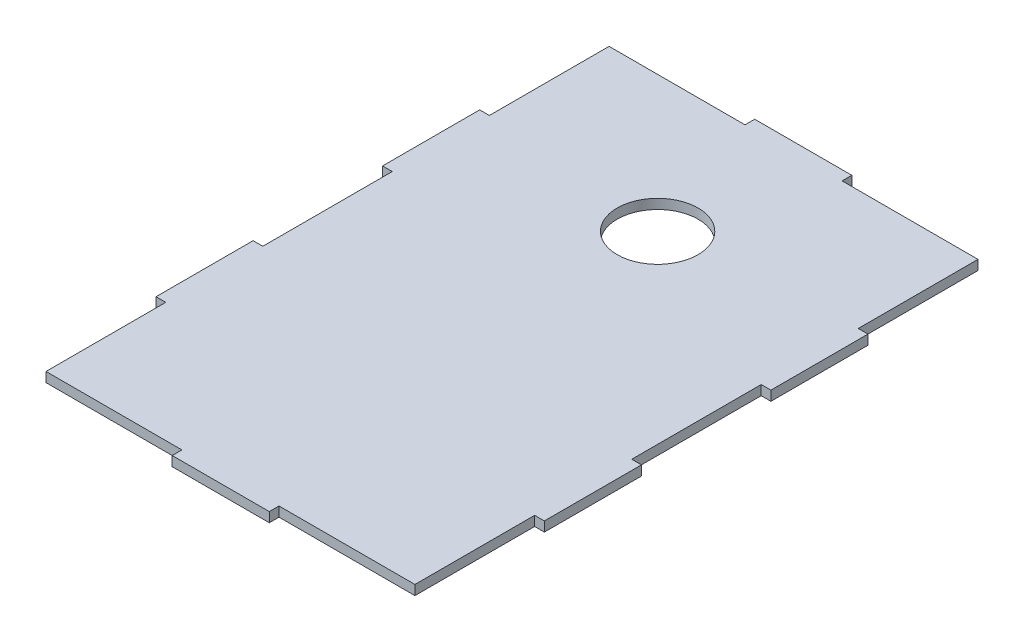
ISO-10303-21;
HEADER;
FILE_DESCRIPTION(('STEP AP214'),'2;1');
FILE_NAME('part.step','',(''),(''),'','','');
FILE_SCHEMA(('AUTOMOTIVE_DESIGN { 1 0 10303 214 1 1 1 1 }'));
ENDSEC;
DATA;
#1=APPLICATION_CONTEXT('core data for automotive mechanical design processes');
#2=APPLICATION_PROTOCOL_DEFINITION('international standard','automotive_design',2000,#1);
#3=PRODUCT_CONTEXT('',#1,'mechanical');
#4=PRODUCT('Part','Part','',(#3));
#5=PRODUCT_RELATED_PRODUCT_CATEGORY('part','',(#4));
#6=PRODUCT_DEFINITION_FORMATION('','',#4);
#7=PRODUCT_DEFINITION_CONTEXT('part definition',#1,'design');
#8=PRODUCT_DEFINITION('design','',#6,#7);
#9=PRODUCT_DEFINITION_SHAPE('','',#8);
#10=(LENGTH_UNIT() NAMED_UNIT(*) SI_UNIT(.MILLI.,.METRE.));
#11=(NAMED_UNIT(*) PLANE_ANGLE_UNIT() SI_UNIT($,.RADIAN.));
#12=(NAMED_UNIT(*) SI_UNIT($,.STERADIAN.) SOLID_ANGLE_UNIT());
#13=UNCERTAINTY_MEASURE_WITH_UNIT(LENGTH_MEASURE(1.E-05),#10,'distance_accuracy_value','');
#14=(GEOMETRIC_REPRESENTATION_CONTEXT(3) GLOBAL_UNCERTAINTY_ASSIGNED_CONTEXT((#13)) GLOBAL_UNIT_ASSIGNED_CONTEXT((#10,
#11,#12)) REPRESENTATION_CONTEXT('',''));
#15=CARTESIAN_POINT('',(0.,0.,0.));
#16=DIRECTION('',(0.,0.,1.));
#17=DIRECTION('',(1.,0.,0.));
#18=AXIS2_PLACEMENT_3D('',#15,#16,#17);
#19=CARTESIAN_POINT('',(0.,3.,0.));
#20=DIRECTION('',(0.,-1.,0.));
#21=DIRECTION('',(0.,0.,-1.));
#22=AXIS2_PLACEMENT_3D('',#19,#20,#21);
#23=PLANE('',#22);
#24=CARTESIAN_POINT('',(0.,3.,-45.));
#25=DIRECTION('',(0.,1.,0.));
#26=DIRECTION('',(0.,0.,1.));
#27=AXIS2_PLACEMENT_3D('',#24,#25,#26);
#28=CIRCLE('',#27,12.5);
#29=CARTESIAN_POINT('',(0.,3.,-32.5));
#30=VERTEX_POINT('',#29);
#31=EDGE_CURVE('E799',#30,#30,#28,.T.);
#32=ORIENTED_EDGE('',*,*,#31,.F.);
#33=EDGE_LOOP('',(#32));
#34=FACE_BOUND('',#33,.T.);
#35=DIRECTION('',(0.,0.,1.));
#36=VECTOR('',#35,1.);
#37=CARTESIAN_POINT('',(-15.,3.,0.));
#38=LINE('',#37,#36);
#39=CARTESIAN_POINT('',(-15.,3.,-90.));
#40=VERTEX_POINT('',#39);
#41=CARTESIAN_POINT('',(-15.,3.,-87.));
#42=VERTEX_POINT('',#41);
#43=EDGE_CURVE('E220',#40,#42,#38,.T.);
#44=ORIENTED_EDGE('',*,*,#43,.T.);
#45=DIRECTION('',(1.,0.,0.));
#46=VECTOR('',#45,1.);
#47=CARTESIAN_POINT('',(0.,3.,-87.));
#48=LINE('',#47,#46);
#49=CARTESIAN_POINT('',(-57.,3.,-87.));
#50=VERTEX_POINT('',#49);
#51=EDGE_CURVE('E227',#50,#42,#48,.T.);
#52=ORIENTED_EDGE('',*,*,#51,.F.);
#53=DIRECTION('',(0.,0.,-1.));
#54=VECTOR('',#53,1.);
#55=CARTESIAN_POINT('',(-57.,3.,-90.));
#56=LINE('',#55,#54);
#57=CARTESIAN_POINT('',(-57.,3.,-50.));
#58=VERTEX_POINT('',#57);
#59=EDGE_CURVE('E325',#58,#50,#56,.T.);
#60=ORIENTED_EDGE('',*,*,#59,.F.);
#61=DIRECTION('',(1.,0.,0.));
#62=VECTOR('',#61,1.);
#63=CARTESIAN_POINT('',(-60.,3.,-50.));
#64=LINE('',#63,#62);
#65=CARTESIAN_POINT('',(-60.,3.,-50.));
#66=VERTEX_POINT('',#65);
#67=EDGE_CURVE('E322',#66,#58,#64,.T.);
#68=ORIENTED_EDGE('',*,*,#67,.F.);
#69=DIRECTION('',(0.,0.,1.));
#70=VECTOR('',#69,1.);
#71=CARTESIAN_POINT('',(-60.,3.,90.));
#72=LINE('',#71,#70);
#73=CARTESIAN_POINT('',(-60.,3.,-20.));
#74=VERTEX_POINT('',#73);
#75=EDGE_CURVE('E367',#66,#74,#72,.T.);
#76=ORIENTED_EDGE('',*,*,#75,.T.);
#77=DIRECTION('',(-1.,0.,0.));
#78=VECTOR('',#77,1.);
#79=CARTESIAN_POINT('',(-60.,3.,-20.));
#80=LINE('',#79,#78);
#81=CARTESIAN_POINT('',(-57.,3.,-20.));
#82=VERTEX_POINT('',#81);
#83=EDGE_CURVE('E348',#82,#74,#80,.T.);
#84=ORIENTED_EDGE('',*,*,#83,.F.);
#85=DIRECTION('',(0.,0.,-1.));
#86=VECTOR('',#85,1.);
#87=CARTESIAN_POINT('',(-57.,3.,20.));
#88=LINE('',#87,#86);
#89=CARTESIAN_POINT('',(-57.,3.,20.));
#90=VERTEX_POINT('',#89);
#91=EDGE_CURVE('E345',#90,#82,#88,.T.);
#92=ORIENTED_EDGE('',*,*,#91,.F.);
#93=DIRECTION('',(1.,0.,0.));
#94=VECTOR('',#93,1.);
#95=CARTESIAN_POINT('',(-60.,3.,20.));
#96=LINE('',#95,#94);
#97=CARTESIAN_POINT('',(-60.,3.,20.));
#98=VERTEX_POINT('',#97);
#99=EDGE_CURVE('E294',#98,#90,#96,.T.);
#100=ORIENTED_EDGE('',*,*,#99,.F.);
#101=CARTESIAN_POINT('',(-60.,3.,50.));
#102=VERTEX_POINT('',#101);
#103=EDGE_CURVE('E364',#98,#102,#72,.T.);
#104=ORIENTED_EDGE('',*,*,#103,.T.);
#105=DIRECTION('',(-1.,0.,0.));
#106=VECTOR('',#105,1.);
#107=CARTESIAN_POINT('',(-60.,3.,50.));
#108=LINE('',#107,#106);
#109=CARTESIAN_POINT('',(-57.,3.,50.));
#110=VERTEX_POINT('',#109);
#111=EDGE_CURVE('E335',#110,#102,#108,.T.);
#112=ORIENTED_EDGE('',*,*,#111,.F.);
#113=DIRECTION('',(0.,0.,-1.));
#114=VECTOR('',#113,1.);
#115=CARTESIAN_POINT('',(-57.,3.,90.));
#116=LINE('',#115,#114);
#117=CARTESIAN_POINT('',(-57.,3.,87.));
#118=VERTEX_POINT('',#117);
#119=EDGE_CURVE('E333',#118,#110,#116,.T.);
#120=ORIENTED_EDGE('',*,*,#119,.F.);
#121=DIRECTION('',(1.,0.,0.));
#122=VECTOR('',#121,1.);
#123=CARTESIAN_POINT('',(0.,3.,87.));
#124=LINE('',#123,#122);
#125=CARTESIAN_POINT('',(-15.,3.,87.));
#126=VERTEX_POINT('',#125);
#127=EDGE_CURVE('E257',#118,#126,#124,.T.);
#128=ORIENTED_EDGE('',*,*,#127,.T.);
#129=DIRECTION('',(0.,0.,-1.));
#130=VECTOR('',#129,1.);
#131=CARTESIAN_POINT('',(-15.,3.,0.));
#132=LINE('',#131,#130);
#133=CARTESIAN_POINT('',(-15.,3.,90.));
#134=VERTEX_POINT('',#133);
#135=EDGE_CURVE('E260',#134,#126,#132,.T.);
#136=ORIENTED_EDGE('',*,*,#135,.F.);
#137=DIRECTION('',(1.,0.,0.));
#138=VECTOR('',#137,1.);
#139=CARTESIAN_POINT('',(-60.,3.,90.));
#140=LINE('',#139,#138);
#141=CARTESIAN_POINT('',(15.,3.,90.));
#142=VERTEX_POINT('',#141);
#143=EDGE_CURVE('E368',#134,#142,#140,.T.);
#144=ORIENTED_EDGE('',*,*,#143,.T.);
#145=DIRECTION('',(0.,0.,-1.));
#146=VECTOR('',#145,1.);
#147=CARTESIAN_POINT('',(15.,3.,0.));
#148=LINE('',#147,#146);
#149=CARTESIAN_POINT('',(15.,3.,87.));
#150=VERTEX_POINT('',#149);
#151=EDGE_CURVE('E271',#142,#150,#148,.T.);
#152=ORIENTED_EDGE('',*,*,#151,.T.);
#153=DIRECTION('',(-1.,0.,0.));
#154=VECTOR('',#153,1.);
#155=CARTESIAN_POINT('',(0.,3.,87.));
#156=LINE('',#155,#154);
#157=CARTESIAN_POINT('',(57.,3.,87.));
#158=VERTEX_POINT('',#157);
#159=EDGE_CURVE('E256',#158,#150,#156,.T.);
#160=ORIENTED_EDGE('',*,*,#159,.F.);
#161=DIRECTION('',(0.,0.,-1.));
#162=VECTOR('',#161,1.);
#163=CARTESIAN_POINT('',(57.,3.,90.));
#164=LINE('',#163,#162);
#165=CARTESIAN_POINT('',(57.,3.,50.));
#166=VERTEX_POINT('',#165);
#167=EDGE_CURVE('E299',#158,#166,#164,.T.);
#168=ORIENTED_EDGE('',*,*,#167,.T.);
#169=DIRECTION('',(1.,0.,0.));
#170=VECTOR('',#169,1.);
#171=CARTESIAN_POINT('',(60.,3.,50.));
#172=LINE('',#171,#170);
#173=CARTESIAN_POINT('',(60.,3.,50.));
#174=VERTEX_POINT('',#173);
#175=EDGE_CURVE('E296',#166,#174,#172,.T.);
#176=ORIENTED_EDGE('',*,*,#175,.T.);
#177=DIRECTION('',(0.,0.,-1.));
#178=VECTOR('',#177,1.);
#179=CARTESIAN_POINT('',(60.,3.,90.));
#180=LINE('',#179,#178);
#181=CARTESIAN_POINT('',(60.,3.,20.));
#182=VERTEX_POINT('',#181);
#183=EDGE_CURVE('E361',#174,#182,#180,.T.);
#184=ORIENTED_EDGE('',*,*,#183,.T.);
#185=DIRECTION('',(-1.,0.,0.));
#186=VECTOR('',#185,1.);
#187=CARTESIAN_POINT('',(60.,3.,20.));
#188=LINE('',#187,#186);
#189=CARTESIAN_POINT('',(57.,3.,20.));
#190=VERTEX_POINT('',#189);
#191=EDGE_CURVE('E311',#182,#190,#188,.T.);
#192=ORIENTED_EDGE('',*,*,#191,.T.);
#193=DIRECTION('',(0.,0.,-1.));
#194=VECTOR('',#193,1.);
#195=CARTESIAN_POINT('',(57.,3.,20.));
#196=LINE('',#195,#194);
#197=CARTESIAN_POINT('',(57.,3.,-20.));
#198=VERTEX_POINT('',#197);
#199=EDGE_CURVE('E308',#190,#198,#196,.T.);
#200=ORIENTED_EDGE('',*,*,#199,.T.);
#201=DIRECTION('',(1.,0.,0.));
#202=VECTOR('',#201,1.);
#203=CARTESIAN_POINT('',(60.,3.,-20.));
#204=LINE('',#203,#202);
#205=CARTESIAN_POINT('',(60.,3.,-20.));
#206=VERTEX_POINT('',#205);
#207=EDGE_CURVE('E282',#198,#206,#204,.T.);
#208=ORIENTED_EDGE('',*,*,#207,.T.);
#209=CARTESIAN_POINT('',(60.,3.,-50.));
#210=VERTEX_POINT('',#209);
#211=EDGE_CURVE('E358',#206,#210,#180,.T.);
#212=ORIENTED_EDGE('',*,*,#211,.T.);
#213=DIRECTION('',(-1.,0.,0.));
#214=VECTOR('',#213,1.);
#215=CARTESIAN_POINT('',(60.,3.,-50.));
#216=LINE('',#215,#214);
#217=CARTESIAN_POINT('',(57.,3.,-50.));
#218=VERTEX_POINT('',#217);
#219=EDGE_CURVE('E286',#210,#218,#216,.T.);
#220=ORIENTED_EDGE('',*,*,#219,.T.);
#221=DIRECTION('',(0.,0.,-1.));
#222=VECTOR('',#221,1.);
#223=CARTESIAN_POINT('',(57.,3.,-90.));
#224=LINE('',#223,#222);
#225=CARTESIAN_POINT('',(57.,3.,-87.));
#226=VERTEX_POINT('',#225);
#227=EDGE_CURVE('E283',#218,#226,#224,.T.);
#228=ORIENTED_EDGE('',*,*,#227,.T.);
#229=DIRECTION('',(-1.,0.,0.));
#230=VECTOR('',#229,1.);
#231=CARTESIAN_POINT('',(0.,3.,-87.));
#232=LINE('',#231,#230);
#233=CARTESIAN_POINT('',(15.,3.,-87.));
#234=VERTEX_POINT('',#233);
#235=EDGE_CURVE('E55',#226,#234,#232,.T.);
#236=ORIENTED_EDGE('',*,*,#235,.T.);
#237=DIRECTION('',(0.,0.,1.));
#238=VECTOR('',#237,1.);
#239=CARTESIAN_POINT('',(15.,3.,0.));
#240=LINE('',#239,#238);
#241=CARTESIAN_POINT('',(15.,3.,-90.));
#242=VERTEX_POINT('',#241);
#243=EDGE_CURVE('E243',#242,#234,#240,.T.);
#244=ORIENTED_EDGE('',*,*,#243,.F.);
#245=DIRECTION('',(-1.,0.,0.));
#246=VECTOR('',#245,1.);
#247=CARTESIAN_POINT('',(-60.,3.,-90.));
#248=LINE('',#247,#246);
#249=EDGE_CURVE('E237',#242,#40,#248,.T.);
#250=ORIENTED_EDGE('',*,*,#249,.T.);
#251=EDGE_LOOP('',(#44,#52,#60,#68,#76,#84,#92,#100,#104,#112,#120,#128,#136,#144,#152,#160,
#168,#176,#184,#192,#200,#208,#212,#220,#228,#236,#244,#250));
#252=FACE_BOUND('',#251,.T.);
#253=ADVANCED_FACE('F32',(#34,#252),#23,.F.);
#254=CARTESIAN_POINT('',(0.,0.,0.));
#255=DIRECTION('',(0.,-1.,0.));
#256=DIRECTION('',(0.,0.,-1.));
#257=AXIS2_PLACEMENT_3D('',#254,#255,#256);
#258=PLANE('',#257);
#259=CARTESIAN_POINT('',(0.,0.,-45.));
#260=DIRECTION('',(0.,-1.,0.));
#261=DIRECTION('',(0.,0.,-1.));
#262=AXIS2_PLACEMENT_3D('',#259,#260,#261);
#263=CIRCLE('',#262,12.5);
#264=CARTESIAN_POINT('',(0.,0.,-57.5));
#265=VERTEX_POINT('',#264);
#266=EDGE_CURVE('E36',#265,#265,#263,.T.);
#267=ORIENTED_EDGE('',*,*,#266,.F.);
#268=EDGE_LOOP('',(#267));
#269=FACE_BOUND('',#268,.T.);
#270=DIRECTION('',(-1.,0.,0.));
#271=VECTOR('',#270,1.);
#272=CARTESIAN_POINT('',(0.,0.,-87.));
#273=LINE('',#272,#271);
#274=CARTESIAN_POINT('',(-15.,0.,-87.));
#275=VERTEX_POINT('',#274);
#276=CARTESIAN_POINT('',(-57.,0.,-87.));
#277=VERTEX_POINT('',#276);
#278=EDGE_CURVE('E48',#275,#277,#273,.T.);
#279=ORIENTED_EDGE('',*,*,#278,.F.);
#280=DIRECTION('',(0.,0.,-1.));
#281=VECTOR('',#280,1.);
#282=CARTESIAN_POINT('',(-15.,0.,0.));
#283=LINE('',#282,#281);
#284=CARTESIAN_POINT('',(-15.,0.,-90.));
#285=VERTEX_POINT('',#284);
#286=EDGE_CURVE('E223',#275,#285,#283,.T.);
#287=ORIENTED_EDGE('',*,*,#286,.T.);
#288=DIRECTION('',(-1.,0.,0.));
#289=VECTOR('',#288,1.);
#290=CARTESIAN_POINT('',(-60.,0.,-90.));
#291=LINE('',#290,#289);
#292=CARTESIAN_POINT('',(15.,0.,-90.));
#293=VERTEX_POINT('',#292);
#294=EDGE_CURVE('E375',#293,#285,#291,.T.);
#295=ORIENTED_EDGE('',*,*,#294,.F.);
#296=DIRECTION('',(0.,0.,-1.));
#297=VECTOR('',#296,1.);
#298=CARTESIAN_POINT('',(15.,0.,0.));
#299=LINE('',#298,#297);
#300=CARTESIAN_POINT('',(15.,0.,-87.));
#301=VERTEX_POINT('',#300);
#302=EDGE_CURVE('E253',#301,#293,#299,.T.);
#303=ORIENTED_EDGE('',*,*,#302,.F.);
#304=DIRECTION('',(1.,0.,0.));
#305=VECTOR('',#304,1.);
#306=CARTESIAN_POINT('',(0.,0.,-87.));
#307=LINE('',#306,#305);
#308=CARTESIAN_POINT('',(57.,0.,-87.));
#309=VERTEX_POINT('',#308);
#310=EDGE_CURVE('E241',#301,#309,#307,.T.);
#311=ORIENTED_EDGE('',*,*,#310,.T.);
#312=DIRECTION('',(0.,0.,1.));
#313=VECTOR('',#312,1.);
#314=CARTESIAN_POINT('',(57.0000000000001,0.,0.));
#315=LINE('',#314,#313);
#316=CARTESIAN_POINT('',(57.,0.,-50.));
#317=VERTEX_POINT('',#316);
#318=EDGE_CURVE('E415',#309,#317,#315,.T.);
#319=ORIENTED_EDGE('',*,*,#318,.T.);
#320=DIRECTION('',(1.,0.,0.));
#321=VECTOR('',#320,1.);
#322=CARTESIAN_POINT('',(0.,0.,-50.));
#323=LINE('',#322,#321);
#324=CARTESIAN_POINT('',(60.,0.,-50.));
#325=VERTEX_POINT('',#324);
#326=EDGE_CURVE('E417',#317,#325,#323,.T.);
#327=ORIENTED_EDGE('',*,*,#326,.T.);
#328=DIRECTION('',(0.,0.,-1.));
#329=VECTOR('',#328,1.);
#330=CARTESIAN_POINT('',(60.,0.,90.));
#331=LINE('',#330,#329);
#332=CARTESIAN_POINT('',(60.,0.,-20.));
#333=VERTEX_POINT('',#332);
#334=EDGE_CURVE('E331',#333,#325,#331,.T.);
#335=ORIENTED_EDGE('',*,*,#334,.F.);
#336=DIRECTION('',(-1.,0.,0.));
#337=VECTOR('',#336,1.);
#338=CARTESIAN_POINT('',(0.,0.,-20.));
#339=LINE('',#338,#337);
#340=CARTESIAN_POINT('',(57.,0.,-20.));
#341=VERTEX_POINT('',#340);
#342=EDGE_CURVE('E400',#333,#341,#339,.T.);
#343=ORIENTED_EDGE('',*,*,#342,.T.);
#344=DIRECTION('',(0.,0.,1.));
#345=VECTOR('',#344,1.);
#346=CARTESIAN_POINT('',(57.,0.,0.));
#347=LINE('',#346,#345);
#348=CARTESIAN_POINT('',(57.,0.,20.));
#349=VERTEX_POINT('',#348);
#350=EDGE_CURVE('E403',#341,#349,#347,.T.);
#351=ORIENTED_EDGE('',*,*,#350,.T.);
#352=DIRECTION('',(1.,0.,0.));
#353=VECTOR('',#352,1.);
#354=CARTESIAN_POINT('',(0.,0.,20.));
#355=LINE('',#354,#353);
#356=CARTESIAN_POINT('',(60.,0.,20.));
#357=VERTEX_POINT('',#356);
#358=EDGE_CURVE('E406',#349,#357,#355,.T.);
#359=ORIENTED_EDGE('',*,*,#358,.T.);
#360=CARTESIAN_POINT('',(60.,0.,50.));
#361=VERTEX_POINT('',#360);
#362=EDGE_CURVE('E374',#361,#357,#331,.T.);
#363=ORIENTED_EDGE('',*,*,#362,.F.);
#364=DIRECTION('',(-1.,0.,0.));
#365=VECTOR('',#364,1.);
#366=CARTESIAN_POINT('',(0.,0.,50.));
#367=LINE('',#366,#365);
#368=CARTESIAN_POINT('',(57.,0.,50.));
#369=VERTEX_POINT('',#368);
#370=EDGE_CURVE('E409',#361,#369,#367,.T.);
#371=ORIENTED_EDGE('',*,*,#370,.T.);
#372=DIRECTION('',(0.,0.,1.));
#373=VECTOR('',#372,1.);
#374=CARTESIAN_POINT('',(57.,0.,0.));
#375=LINE('',#374,#373);
#376=CARTESIAN_POINT('',(57.,0.,87.));
#377=VERTEX_POINT('',#376);
#378=EDGE_CURVE('E412',#369,#377,#375,.T.);
#379=ORIENTED_EDGE('',*,*,#378,.T.);
#380=DIRECTION('',(1.,0.,0.));
#381=VECTOR('',#380,1.);
#382=CARTESIAN_POINT('',(0.,0.,87.));
#383=LINE('',#382,#381);
#384=CARTESIAN_POINT('',(15.,0.,87.));
#385=VERTEX_POINT('',#384);
#386=EDGE_CURVE('E267',#385,#377,#383,.T.);
#387=ORIENTED_EDGE('',*,*,#386,.F.);
#388=DIRECTION('',(0.,0.,1.));
#389=VECTOR('',#388,1.);
#390=CARTESIAN_POINT('',(15.,0.,0.));
#391=LINE('',#390,#389);
#392=CARTESIAN_POINT('',(15.,0.,90.));
#393=VERTEX_POINT('',#392);
#394=EDGE_CURVE('E424',#385,#393,#391,.T.);
#395=ORIENTED_EDGE('',*,*,#394,.T.);
#396=DIRECTION('',(1.,0.,0.));
#397=VECTOR('',#396,1.);
#398=CARTESIAN_POINT('',(-60.,0.,90.));
#399=LINE('',#398,#397);
#400=CARTESIAN_POINT('',(-15.,0.,90.));
#401=VERTEX_POINT('',#400);
#402=EDGE_CURVE('E362',#401,#393,#399,.T.);
#403=ORIENTED_EDGE('',*,*,#402,.F.);
#404=DIRECTION('',(0.,0.,1.));
#405=VECTOR('',#404,1.);
#406=CARTESIAN_POINT('',(-15.,0.,0.));
#407=LINE('',#406,#405);
#408=CARTESIAN_POINT('',(-15.,0.,87.));
#409=VERTEX_POINT('',#408);
#410=EDGE_CURVE('E427',#409,#401,#407,.T.);
#411=ORIENTED_EDGE('',*,*,#410,.F.);
#412=DIRECTION('',(-1.,0.,0.));
#413=VECTOR('',#412,1.);
#414=CARTESIAN_POINT('',(0.,0.,87.));
#415=LINE('',#414,#413);
#416=CARTESIAN_POINT('',(-57.,0.,87.));
#417=VERTEX_POINT('',#416);
#418=EDGE_CURVE('E279',#409,#417,#415,.T.);
#419=ORIENTED_EDGE('',*,*,#418,.T.);
#420=DIRECTION('',(0.,0.,1.));
#421=VECTOR('',#420,1.);
#422=CARTESIAN_POINT('',(-57.,0.,0.));
#423=LINE('',#422,#421);
#424=CARTESIAN_POINT('',(-57.,0.,50.));
#425=VERTEX_POINT('',#424);
#426=EDGE_CURVE('E390',#425,#417,#423,.T.);
#427=ORIENTED_EDGE('',*,*,#426,.F.);
#428=DIRECTION('',(1.,0.,0.));
#429=VECTOR('',#428,1.);
#430=CARTESIAN_POINT('',(0.,0.,50.));
#431=LINE('',#430,#429);
#432=CARTESIAN_POINT('',(-60.,0.,50.));
#433=VERTEX_POINT('',#432);
#434=EDGE_CURVE('E393',#433,#425,#431,.T.);
#435=ORIENTED_EDGE('',*,*,#434,.F.);
#436=DIRECTION('',(0.,0.,1.));
#437=VECTOR('',#436,1.);
#438=CARTESIAN_POINT('',(-60.,0.,90.));
#439=LINE('',#438,#437);
#440=CARTESIAN_POINT('',(-60.,0.,20.));
#441=VERTEX_POINT('',#440);
#442=EDGE_CURVE('E378',#441,#433,#439,.T.);
#443=ORIENTED_EDGE('',*,*,#442,.F.);
#444=DIRECTION('',(-1.,0.,0.));
#445=VECTOR('',#444,1.);
#446=CARTESIAN_POINT('',(0.,0.,20.));
#447=LINE('',#446,#445);
#448=CARTESIAN_POINT('',(-57.,0.,20.));
#449=VERTEX_POINT('',#448);
#450=EDGE_CURVE('E371',#449,#441,#447,.T.);
#451=ORIENTED_EDGE('',*,*,#450,.F.);
#452=DIRECTION('',(0.,0.,1.));
#453=VECTOR('',#452,1.);
#454=CARTESIAN_POINT('',(-57.,0.,0.));
#455=LINE('',#454,#453);
#456=CARTESIAN_POINT('',(-57.,0.,-20.));
#457=VERTEX_POINT('',#456);
#458=EDGE_CURVE('E385',#457,#449,#455,.T.);
#459=ORIENTED_EDGE('',*,*,#458,.F.);
#460=DIRECTION('',(1.,0.,0.));
#461=VECTOR('',#460,1.);
#462=CARTESIAN_POINT('',(0.,0.,-20.));
#463=LINE('',#462,#461);
#464=CARTESIAN_POINT('',(-60.,0.,-20.));
#465=VERTEX_POINT('',#464);
#466=EDGE_CURVE('E388',#465,#457,#463,.T.);
#467=ORIENTED_EDGE('',*,*,#466,.F.);
#468=CARTESIAN_POINT('',(-60.,0.,-50.));
#469=VERTEX_POINT('',#468);
#470=EDGE_CURVE('E381',#469,#465,#439,.T.);
#471=ORIENTED_EDGE('',*,*,#470,.F.);
#472=DIRECTION('',(-1.,0.,0.));
#473=VECTOR('',#472,1.);
#474=CARTESIAN_POINT('',(0.,0.,-50.));
#475=LINE('',#474,#473);
#476=CARTESIAN_POINT('',(-57.,0.,-50.));
#477=VERTEX_POINT('',#476);
#478=EDGE_CURVE('E396',#477,#469,#475,.T.);
#479=ORIENTED_EDGE('',*,*,#478,.F.);
#480=DIRECTION('',(0.,0.,1.));
#481=VECTOR('',#480,1.);
#482=CARTESIAN_POINT('',(-57.0000000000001,0.,0.));
#483=LINE('',#482,#481);
#484=EDGE_CURVE('E398',#277,#477,#483,.T.);
#485=ORIENTED_EDGE('',*,*,#484,.F.);
#486=EDGE_LOOP('',(#279,#287,#295,#303,#311,#319,#327,#335,#343,#351,#359,#363,#371,#379,#387,
#395,#403,#411,#419,#427,#435,#443,#451,#459,#467,#471,#479,#485));
#487=FACE_BOUND('',#486,.T.);
#488=ADVANCED_FACE('F442',(#269,#487),#258,.T.);
#489=CARTESIAN_POINT('',(-60.,3.,-90.));
#490=DIRECTION('',(0.,0.,1.));
#491=DIRECTION('',(1.,0.,0.));
#492=AXIS2_PLACEMENT_3D('',#489,#490,#491);
#493=PLANE('',#492);
#494=DIRECTION('',(0.,1.,0.));
#495=VECTOR('',#494,1.);
#496=CARTESIAN_POINT('',(-15.,-7.,-90.));
#497=LINE('',#496,#495);
#498=EDGE_CURVE('E224',#285,#40,#497,.T.);
#499=ORIENTED_EDGE('',*,*,#498,.T.);
#500=ORIENTED_EDGE('',*,*,#249,.F.);
#501=DIRECTION('',(0.,1.,0.));
#502=VECTOR('',#501,1.);
#503=CARTESIAN_POINT('',(15.,-7.,-90.));
#504=LINE('',#503,#502);
#505=EDGE_CURVE('E247',#293,#242,#504,.T.);
#506=ORIENTED_EDGE('',*,*,#505,.F.);
#507=ORIENTED_EDGE('',*,*,#294,.T.);
#508=EDGE_LOOP('',(#499,#500,#506,#507));
#509=FACE_BOUND('',#508,.T.);
#510=ADVANCED_FACE('F451',(#509),#493,.F.);
#511=CARTESIAN_POINT('',(57.,-7.,-90.));
#512=DIRECTION('',(1.,0.,0.));
#513=DIRECTION('',(0.,0.,-1.));
#514=AXIS2_PLACEMENT_3D('',#511,#512,#513);
#515=PLANE('',#514);
#516=ORIENTED_EDGE('',*,*,#318,.F.);
#517=DIRECTION('',(0.,1.,0.));
#518=VECTOR('',#517,1.);
#519=CARTESIAN_POINT('',(57.,-7.,-87.));
#520=LINE('',#519,#518);
#521=EDGE_CURVE('E41',#309,#226,#520,.T.);
#522=ORIENTED_EDGE('',*,*,#521,.T.);
#523=ORIENTED_EDGE('',*,*,#227,.F.);
#524=DIRECTION('',(0.,1.,0.));
#525=VECTOR('',#524,1.);
#526=CARTESIAN_POINT('',(57.,-7.,-50.));
#527=LINE('',#526,#525);
#528=EDGE_CURVE('E290',#317,#218,#527,.T.);
#529=ORIENTED_EDGE('',*,*,#528,.F.);
#530=EDGE_LOOP('',(#516,#522,#523,#529));
#531=FACE_BOUND('',#530,.T.);
#532=ADVANCED_FACE('F432',(#531),#515,.T.);
#533=CARTESIAN_POINT('',(-60.,3.,90.));
#534=DIRECTION('',(0.,0.,-1.));
#535=DIRECTION('',(-1.,0.,0.));
#536=AXIS2_PLACEMENT_3D('',#533,#534,#535);
#537=PLANE('',#536);
#538=ORIENTED_EDGE('',*,*,#143,.F.);
#539=DIRECTION('',(0.,1.,0.));
#540=VECTOR('',#539,1.);
#541=CARTESIAN_POINT('',(-15.,-7.,90.));
#542=LINE('',#541,#540);
#543=EDGE_CURVE('E264',#401,#134,#542,.T.);
#544=ORIENTED_EDGE('',*,*,#543,.F.);
#545=ORIENTED_EDGE('',*,*,#402,.T.);
#546=DIRECTION('',(0.,1.,0.));
#547=VECTOR('',#546,1.);
#548=CARTESIAN_POINT('',(15.,-7.,90.));
#549=LINE('',#548,#547);
#550=EDGE_CURVE('E261',#393,#142,#549,.T.);
#551=ORIENTED_EDGE('',*,*,#550,.T.);
#552=EDGE_LOOP('',(#538,#544,#545,#551));
#553=FACE_BOUND('',#552,.T.);
#554=ADVANCED_FACE('F504',(#553),#537,.F.);
#555=CARTESIAN_POINT('',(-57.,-7.,90.));
#556=DIRECTION('',(1.,0.,0.));
#557=DIRECTION('',(0.,0.,-1.));
#558=AXIS2_PLACEMENT_3D('',#555,#556,#557);
#559=PLANE('',#558);
#560=DIRECTION('',(0.,-1.,0.));
#561=VECTOR('',#560,1.);
#562=CARTESIAN_POINT('',(-57.,-7.,87.));
#563=LINE('',#562,#561);
#564=EDGE_CURVE('E422',#118,#417,#563,.T.);
#565=ORIENTED_EDGE('',*,*,#564,.F.);
#566=ORIENTED_EDGE('',*,*,#119,.T.);
#567=DIRECTION('',(0.,1.,0.));
#568=VECTOR('',#567,1.);
#569=CARTESIAN_POINT('',(-57.,-7.,50.));
#570=LINE('',#569,#568);
#571=EDGE_CURVE('E338',#425,#110,#570,.T.);
#572=ORIENTED_EDGE('',*,*,#571,.F.);
#573=ORIENTED_EDGE('',*,*,#426,.T.);
#574=EDGE_LOOP('',(#565,#566,#572,#573));
#575=FACE_BOUND('',#574,.T.);
#576=ADVANCED_FACE('F492',(#575),#559,.F.);
#577=CARTESIAN_POINT('',(60.,3.,90.));
#578=DIRECTION('',(-1.,0.,0.));
#579=DIRECTION('',(0.,0.,1.));
#580=AXIS2_PLACEMENT_3D('',#577,#578,#579);
#581=PLANE('',#580);
#582=DIRECTION('',(0.,1.,0.));
#583=VECTOR('',#582,1.);
#584=CARTESIAN_POINT('',(60.,-7.,-50.));
#585=LINE('',#584,#583);
#586=EDGE_CURVE('E291',#325,#210,#585,.T.);
#587=ORIENTED_EDGE('',*,*,#586,.T.);
#588=ORIENTED_EDGE('',*,*,#211,.F.);
#589=DIRECTION('',(0.,1.,0.));
#590=VECTOR('',#589,1.);
#591=CARTESIAN_POINT('',(60.,-7.,-20.));
#592=LINE('',#591,#590);
#593=EDGE_CURVE('E314',#333,#206,#592,.T.);
#594=ORIENTED_EDGE('',*,*,#593,.F.);
#595=ORIENTED_EDGE('',*,*,#334,.T.);
#596=EDGE_LOOP('',(#587,#588,#594,#595));
#597=FACE_BOUND('',#596,.T.);
#598=ADVANCED_FACE('F34',(#597),#581,.F.);
#599=DIRECTION('',(0.,1.,0.));
#600=VECTOR('',#599,1.);
#601=CARTESIAN_POINT('',(60.,-7.,50.));
#602=LINE('',#601,#600);
#603=EDGE_CURVE('E302',#361,#174,#602,.T.);
#604=ORIENTED_EDGE('',*,*,#603,.F.);
#605=ORIENTED_EDGE('',*,*,#362,.T.);
#606=DIRECTION('',(0.,1.,0.));
#607=VECTOR('',#606,1.);
#608=CARTESIAN_POINT('',(60.,-7.,20.));
#609=LINE('',#608,#607);
#610=EDGE_CURVE('E300',#357,#182,#609,.T.);
#611=ORIENTED_EDGE('',*,*,#610,.T.);
#612=ORIENTED_EDGE('',*,*,#183,.F.);
#613=EDGE_LOOP('',(#604,#605,#611,#612));
#614=FACE_BOUND('',#613,.T.);
#615=ADVANCED_FACE('F524',(#614),#581,.F.);
#616=CARTESIAN_POINT('',(-60.,3.,90.));
#617=DIRECTION('',(1.,0.,0.));
#618=DIRECTION('',(0.,0.,-1.));
#619=AXIS2_PLACEMENT_3D('',#616,#617,#618);
#620=PLANE('',#619);
#621=ORIENTED_EDGE('',*,*,#75,.F.);
#622=DIRECTION('',(0.,1.,0.));
#623=VECTOR('',#622,1.);
#624=CARTESIAN_POINT('',(-60.,-7.,-50.));
#625=LINE('',#624,#623);
#626=EDGE_CURVE('E328',#469,#66,#625,.T.);
#627=ORIENTED_EDGE('',*,*,#626,.F.);
#628=ORIENTED_EDGE('',*,*,#470,.T.);
#629=DIRECTION('',(0.,1.,0.));
#630=VECTOR('',#629,1.);
#631=CARTESIAN_POINT('',(-60.,-7.,-20.));
#632=LINE('',#631,#630);
#633=EDGE_CURVE('E336',#465,#74,#632,.T.);
#634=ORIENTED_EDGE('',*,*,#633,.T.);
#635=EDGE_LOOP('',(#621,#627,#628,#634));
#636=FACE_BOUND('',#635,.T.);
#637=ADVANCED_FACE('F466',(#636),#620,.F.);
#638=ORIENTED_EDGE('',*,*,#442,.T.);
#639=DIRECTION('',(0.,1.,0.));
#640=VECTOR('',#639,1.);
#641=CARTESIAN_POINT('',(-60.,-7.,50.));
#642=LINE('',#641,#640);
#643=EDGE_CURVE('E326',#433,#102,#642,.T.);
#644=ORIENTED_EDGE('',*,*,#643,.T.);
#645=ORIENTED_EDGE('',*,*,#103,.F.);
#646=DIRECTION('',(0.,1.,0.));
#647=VECTOR('',#646,1.);
#648=CARTESIAN_POINT('',(-60.,-7.,20.));
#649=LINE('',#648,#647);
#650=EDGE_CURVE('E350',#441,#98,#649,.T.);
#651=ORIENTED_EDGE('',*,*,#650,.F.);
#652=EDGE_LOOP('',(#638,#644,#645,#651));
#653=FACE_BOUND('',#652,.T.);
#654=ADVANCED_FACE('F484',(#653),#620,.F.);
#655=CARTESIAN_POINT('',(-60.,-7.,-20.));
#656=DIRECTION('',(0.,0.,-1.));
#657=DIRECTION('',(-1.,0.,0.));
#658=AXIS2_PLACEMENT_3D('',#655,#656,#657);
#659=PLANE('',#658);
#660=ORIENTED_EDGE('',*,*,#466,.T.);
#661=DIRECTION('',(0.,1.,0.));
#662=VECTOR('',#661,1.);
#663=CARTESIAN_POINT('',(-57.,-7.,-20.));
#664=LINE('',#663,#662);
#665=EDGE_CURVE('E353',#457,#82,#664,.T.);
#666=ORIENTED_EDGE('',*,*,#665,.T.);
#667=ORIENTED_EDGE('',*,*,#83,.T.);
#668=ORIENTED_EDGE('',*,*,#633,.F.);
#669=EDGE_LOOP('',(#660,#666,#667,#668));
#670=FACE_BOUND('',#669,.T.);
#671=ADVANCED_FACE('F470',(#670),#659,.F.);
#672=CARTESIAN_POINT('',(-57.,-7.,20.));
#673=DIRECTION('',(1.,0.,0.));
#674=DIRECTION('',(0.,0.,-1.));
#675=AXIS2_PLACEMENT_3D('',#672,#673,#674);
#676=PLANE('',#675);
#677=ORIENTED_EDGE('',*,*,#458,.T.);
#678=DIRECTION('',(0.,1.,0.));
#679=VECTOR('',#678,1.);
#680=CARTESIAN_POINT('',(-57.,-7.,20.));
#681=LINE('',#680,#679);
#682=EDGE_CURVE('E355',#449,#90,#681,.T.);
#683=ORIENTED_EDGE('',*,*,#682,.T.);
#684=ORIENTED_EDGE('',*,*,#91,.T.);
#685=ORIENTED_EDGE('',*,*,#665,.F.);
#686=EDGE_LOOP('',(#677,#683,#684,#685));
#687=FACE_BOUND('',#686,.T.);
#688=ADVANCED_FACE('F476',(#687),#676,.F.);
#689=CARTESIAN_POINT('',(-60.,-7.,20.));
#690=DIRECTION('',(0.,0.,1.));
#691=DIRECTION('',(1.,0.,0.));
#692=AXIS2_PLACEMENT_3D('',#689,#690,#691);
#693=PLANE('',#692);
#694=ORIENTED_EDGE('',*,*,#450,.T.);
#695=ORIENTED_EDGE('',*,*,#650,.T.);
#696=ORIENTED_EDGE('',*,*,#99,.T.);
#697=ORIENTED_EDGE('',*,*,#682,.F.);
#698=EDGE_LOOP('',(#694,#695,#696,#697));
#699=FACE_BOUND('',#698,.T.);
#700=ADVANCED_FACE('F557',(#699),#693,.F.);
#701=CARTESIAN_POINT('',(-60.,-7.,50.));
#702=DIRECTION('',(0.,0.,-1.));
#703=DIRECTION('',(-1.,0.,0.));
#704=AXIS2_PLACEMENT_3D('',#701,#702,#703);
#705=PLANE('',#704);
#706=ORIENTED_EDGE('',*,*,#434,.T.);
#707=ORIENTED_EDGE('',*,*,#571,.T.);
#708=ORIENTED_EDGE('',*,*,#111,.T.);
#709=ORIENTED_EDGE('',*,*,#643,.F.);
#710=EDGE_LOOP('',(#706,#707,#708,#709));
#711=FACE_BOUND('',#710,.T.);
#712=ADVANCED_FACE('F487',(#711),#705,.F.);
#713=CARTESIAN_POINT('',(-57.,-7.,-90.));
#714=DIRECTION('',(1.,0.,0.));
#715=DIRECTION('',(0.,0.,-1.));
#716=AXIS2_PLACEMENT_3D('',#713,#714,#715);
#717=PLANE('',#716);
#718=ORIENTED_EDGE('',*,*,#59,.T.);
#719=DIRECTION('',(0.,-1.,0.));
#720=VECTOR('',#719,1.);
#721=CARTESIAN_POINT('',(-57.,-7.,-87.));
#722=LINE('',#721,#720);
#723=EDGE_CURVE('E11',#50,#277,#722,.T.);
#724=ORIENTED_EDGE('',*,*,#723,.T.);
#725=ORIENTED_EDGE('',*,*,#484,.T.);
#726=DIRECTION('',(0.,1.,0.));
#727=VECTOR('',#726,1.);
#728=CARTESIAN_POINT('',(-57.,-7.,-50.));
#729=LINE('',#728,#727);
#730=EDGE_CURVE('E329',#477,#58,#729,.T.);
#731=ORIENTED_EDGE('',*,*,#730,.T.);
#732=EDGE_LOOP('',(#718,#724,#725,#731));
#733=FACE_BOUND('',#732,.T.);
#734=ADVANCED_FACE('F457',(#733),#717,.F.);
#735=CARTESIAN_POINT('',(-60.,-7.,-50.));
#736=DIRECTION('',(0.,0.,1.));
#737=DIRECTION('',(1.,0.,0.));
#738=AXIS2_PLACEMENT_3D('',#735,#736,#737);
#739=PLANE('',#738);
#740=ORIENTED_EDGE('',*,*,#478,.T.);
#741=ORIENTED_EDGE('',*,*,#626,.T.);
#742=ORIENTED_EDGE('',*,*,#67,.T.);
#743=ORIENTED_EDGE('',*,*,#730,.F.);
#744=EDGE_LOOP('',(#740,#741,#742,#743));
#745=FACE_BOUND('',#744,.T.);
#746=ADVANCED_FACE('F459',(#745),#739,.F.);
#747=CARTESIAN_POINT('',(60.,-7.,20.));
#748=DIRECTION('',(0.,0.,-1.));
#749=DIRECTION('',(-1.,0.,0.));
#750=AXIS2_PLACEMENT_3D('',#747,#748,#749);
#751=PLANE('',#750);
#752=DIRECTION('',(0.,1.,0.));
#753=VECTOR('',#752,1.);
#754=CARTESIAN_POINT('',(57.,-7.,20.));
#755=LINE('',#754,#753);
#756=EDGE_CURVE('E317',#349,#190,#755,.T.);
#757=ORIENTED_EDGE('',*,*,#756,.T.);
#758=ORIENTED_EDGE('',*,*,#191,.F.);
#759=ORIENTED_EDGE('',*,*,#610,.F.);
#760=ORIENTED_EDGE('',*,*,#358,.F.);
#761=EDGE_LOOP('',(#757,#758,#759,#760));
#762=FACE_BOUND('',#761,.T.);
#763=ADVANCED_FACE('F528',(#762),#751,.T.);
#764=CARTESIAN_POINT('',(57.,-7.,20.));
#765=DIRECTION('',(1.,0.,0.));
#766=DIRECTION('',(0.,0.,-1.));
#767=AXIS2_PLACEMENT_3D('',#764,#765,#766);
#768=PLANE('',#767);
#769=DIRECTION('',(0.,1.,0.));
#770=VECTOR('',#769,1.);
#771=CARTESIAN_POINT('',(57.,-7.,-20.));
#772=LINE('',#771,#770);
#773=EDGE_CURVE('E319',#341,#198,#772,.T.);
#774=ORIENTED_EDGE('',*,*,#773,.T.);
#775=ORIENTED_EDGE('',*,*,#199,.F.);
#776=ORIENTED_EDGE('',*,*,#756,.F.);
#777=ORIENTED_EDGE('',*,*,#350,.F.);
#778=EDGE_LOOP('',(#774,#775,#776,#777));
#779=FACE_BOUND('',#778,.T.);
#780=ADVANCED_FACE('F532',(#779),#768,.T.);
#781=CARTESIAN_POINT('',(60.,-7.,-20.));
#782=DIRECTION('',(0.,0.,1.));
#783=DIRECTION('',(1.,0.,0.));
#784=AXIS2_PLACEMENT_3D('',#781,#782,#783);
#785=PLANE('',#784);
#786=ORIENTED_EDGE('',*,*,#593,.T.);
#787=ORIENTED_EDGE('',*,*,#207,.F.);
#788=ORIENTED_EDGE('',*,*,#773,.F.);
#789=ORIENTED_EDGE('',*,*,#342,.F.);
#790=EDGE_LOOP('',(#786,#787,#788,#789));
#791=FACE_BOUND('',#790,.T.);
#792=ADVANCED_FACE('F536',(#791),#785,.T.);
#793=CARTESIAN_POINT('',(57.,-7.,90.));
#794=DIRECTION('',(1.,0.,0.));
#795=DIRECTION('',(0.,0.,-1.));
#796=AXIS2_PLACEMENT_3D('',#793,#794,#795);
#797=PLANE('',#796);
#798=DIRECTION('',(0.,1.,0.));
#799=VECTOR('',#798,1.);
#800=CARTESIAN_POINT('',(57.,-7.,87.));
#801=LINE('',#800,#799);
#802=EDGE_CURVE('E420',#377,#158,#801,.T.);
#803=ORIENTED_EDGE('',*,*,#802,.F.);
#804=ORIENTED_EDGE('',*,*,#378,.F.);
#805=DIRECTION('',(0.,1.,0.));
#806=VECTOR('',#805,1.);
#807=CARTESIAN_POINT('',(57.,-7.,50.));
#808=LINE('',#807,#806);
#809=EDGE_CURVE('E287',#369,#166,#808,.T.);
#810=ORIENTED_EDGE('',*,*,#809,.T.);
#811=ORIENTED_EDGE('',*,*,#167,.F.);
#812=EDGE_LOOP('',(#803,#804,#810,#811));
#813=FACE_BOUND('',#812,.T.);
#814=ADVANCED_FACE('F515',(#813),#797,.T.);
#815=CARTESIAN_POINT('',(60.,-7.,50.));
#816=DIRECTION('',(0.,0.,1.));
#817=DIRECTION('',(1.,0.,0.));
#818=AXIS2_PLACEMENT_3D('',#815,#816,#817);
#819=PLANE('',#818);
#820=ORIENTED_EDGE('',*,*,#603,.T.);
#821=ORIENTED_EDGE('',*,*,#175,.F.);
#822=ORIENTED_EDGE('',*,*,#809,.F.);
#823=ORIENTED_EDGE('',*,*,#370,.F.);
#824=EDGE_LOOP('',(#820,#821,#822,#823));
#825=FACE_BOUND('',#824,.T.);
#826=ADVANCED_FACE('F519',(#825),#819,.T.);
#827=CARTESIAN_POINT('',(60.,-7.,-50.));
#828=DIRECTION('',(0.,0.,-1.));
#829=DIRECTION('',(-1.,0.,0.));
#830=AXIS2_PLACEMENT_3D('',#827,#828,#829);
#831=PLANE('',#830);
#832=ORIENTED_EDGE('',*,*,#528,.T.);
#833=ORIENTED_EDGE('',*,*,#219,.F.);
#834=ORIENTED_EDGE('',*,*,#586,.F.);
#835=ORIENTED_EDGE('',*,*,#326,.F.);
#836=EDGE_LOOP('',(#832,#833,#834,#835));
#837=FACE_BOUND('',#836,.T.);
#838=ADVANCED_FACE('F436',(#837),#831,.T.);
#839=CARTESIAN_POINT('',(15.,-7.,0.));
#840=DIRECTION('',(1.,0.,0.));
#841=DIRECTION('',(0.,0.,-1.));
#842=AXIS2_PLACEMENT_3D('',#839,#840,#841);
#843=PLANE('',#842);
#844=DIRECTION('',(0.,1.,0.));
#845=VECTOR('',#844,1.);
#846=CARTESIAN_POINT('',(15.,-7.,87.));
#847=LINE('',#846,#845);
#848=EDGE_CURVE('E274',#385,#150,#847,.T.);
#849=ORIENTED_EDGE('',*,*,#848,.T.);
#850=ORIENTED_EDGE('',*,*,#151,.F.);
#851=ORIENTED_EDGE('',*,*,#550,.F.);
#852=ORIENTED_EDGE('',*,*,#394,.F.);
#853=EDGE_LOOP('',(#849,#850,#851,#852));
#854=FACE_BOUND('',#853,.T.);
#855=ADVANCED_FACE('F508',(#854),#843,.T.);
#856=CARTESIAN_POINT('',(0.,-7.,87.));
#857=DIRECTION('',(0.,0.,-1.));
#858=DIRECTION('',(-1.,0.,0.));
#859=AXIS2_PLACEMENT_3D('',#856,#857,#858);
#860=PLANE('',#859);
#861=ORIENTED_EDGE('',*,*,#386,.T.);
#862=ORIENTED_EDGE('',*,*,#802,.T.);
#863=ORIENTED_EDGE('',*,*,#159,.T.);
#864=ORIENTED_EDGE('',*,*,#848,.F.);
#865=EDGE_LOOP('',(#861,#862,#863,#864));
#866=FACE_BOUND('',#865,.T.);
#867=ADVANCED_FACE('F510',(#866),#860,.F.);
#868=CARTESIAN_POINT('',(0.,-7.,87.));
#869=DIRECTION('',(0.,0.,1.));
#870=DIRECTION('',(1.,0.,0.));
#871=AXIS2_PLACEMENT_3D('',#868,#869,#870);
#872=PLANE('',#871);
#873=DIRECTION('',(0.,1.,0.));
#874=VECTOR('',#873,1.);
#875=CARTESIAN_POINT('',(-15.,-7.,87.));
#876=LINE('',#875,#874);
#877=EDGE_CURVE('E265',#409,#126,#876,.T.);
#878=ORIENTED_EDGE('',*,*,#877,.T.);
#879=ORIENTED_EDGE('',*,*,#127,.F.);
#880=ORIENTED_EDGE('',*,*,#564,.T.);
#881=ORIENTED_EDGE('',*,*,#418,.F.);
#882=EDGE_LOOP('',(#878,#879,#880,#881));
#883=FACE_BOUND('',#882,.T.);
#884=ADVANCED_FACE('F497',(#883),#872,.T.);
#885=CARTESIAN_POINT('',(-15.,-7.,0.));
#886=DIRECTION('',(1.,0.,0.));
#887=DIRECTION('',(0.,0.,-1.));
#888=AXIS2_PLACEMENT_3D('',#885,#886,#887);
#889=PLANE('',#888);
#890=ORIENTED_EDGE('',*,*,#410,.T.);
#891=ORIENTED_EDGE('',*,*,#543,.T.);
#892=ORIENTED_EDGE('',*,*,#135,.T.);
#893=ORIENTED_EDGE('',*,*,#877,.F.);
#894=EDGE_LOOP('',(#890,#891,#892,#893));
#895=FACE_BOUND('',#894,.T.);
#896=ADVANCED_FACE('F500',(#895),#889,.F.);
#897=CARTESIAN_POINT('',(0.,-7.,-87.));
#898=DIRECTION('',(0.,0.,-1.));
#899=DIRECTION('',(-1.,0.,0.));
#900=AXIS2_PLACEMENT_3D('',#897,#898,#899);
#901=PLANE('',#900);
#902=DIRECTION('',(0.,1.,0.));
#903=VECTOR('',#902,1.);
#904=CARTESIAN_POINT('',(15.,-7.,-87.));
#905=LINE('',#904,#903);
#906=EDGE_CURVE('E232',#301,#234,#905,.T.);
#907=ORIENTED_EDGE('',*,*,#906,.T.);
#908=ORIENTED_EDGE('',*,*,#235,.F.);
#909=ORIENTED_EDGE('',*,*,#521,.F.);
#910=ORIENTED_EDGE('',*,*,#310,.F.);
#911=EDGE_LOOP('',(#907,#908,#909,#910));
#912=FACE_BOUND('',#911,.T.);
#913=ADVANCED_FACE('F446',(#912),#901,.T.);
#914=CARTESIAN_POINT('',(15.,-7.,0.));
#915=DIRECTION('',(-1.,0.,0.));
#916=DIRECTION('',(0.,0.,1.));
#917=AXIS2_PLACEMENT_3D('',#914,#915,#916);
#918=PLANE('',#917);
#919=ORIENTED_EDGE('',*,*,#302,.T.);
#920=ORIENTED_EDGE('',*,*,#505,.T.);
#921=ORIENTED_EDGE('',*,*,#243,.T.);
#922=ORIENTED_EDGE('',*,*,#906,.F.);
#923=EDGE_LOOP('',(#919,#920,#921,#922));
#924=FACE_BOUND('',#923,.T.);
#925=ADVANCED_FACE('F448',(#924),#918,.F.);
#926=CARTESIAN_POINT('',(0.,-7.,-87.));
#927=DIRECTION('',(0.,0.,1.));
#928=DIRECTION('',(1.,0.,0.));
#929=AXIS2_PLACEMENT_3D('',#926,#927,#928);
#930=PLANE('',#929);
#931=ORIENTED_EDGE('',*,*,#278,.T.);
#932=ORIENTED_EDGE('',*,*,#723,.F.);
#933=ORIENTED_EDGE('',*,*,#51,.T.);
#934=DIRECTION('',(0.,1.,0.));
#935=VECTOR('',#934,1.);
#936=CARTESIAN_POINT('',(-15.,-7.,-87.));
#937=LINE('',#936,#935);
#938=EDGE_CURVE('E216',#275,#42,#937,.T.);
#939=ORIENTED_EDGE('',*,*,#938,.F.);
#940=EDGE_LOOP('',(#931,#932,#933,#939));
#941=FACE_BOUND('',#940,.T.);
#942=ADVANCED_FACE('F228',(#941),#930,.F.);
#943=CARTESIAN_POINT('',(-15.,-7.,0.));
#944=DIRECTION('',(-1.,0.,0.));
#945=DIRECTION('',(0.,0.,1.));
#946=AXIS2_PLACEMENT_3D('',#943,#944,#945);
#947=PLANE('',#946);
#948=ORIENTED_EDGE('',*,*,#938,.T.);
#949=ORIENTED_EDGE('',*,*,#43,.F.);
#950=ORIENTED_EDGE('',*,*,#498,.F.);
#951=ORIENTED_EDGE('',*,*,#286,.F.);
#952=EDGE_LOOP('',(#948,#949,#950,#951));
#953=FACE_BOUND('',#952,.T.);
#954=ADVANCED_FACE('F218',(#953),#947,.T.);
#955=CARTESIAN_POINT('',(0.,-7.,-45.));
#956=DIRECTION('',(0.,1.,0.));
#957=DIRECTION('',(0.,0.,1.));
#958=AXIS2_PLACEMENT_3D('',#955,#956,#957);
#959=CYLINDRICAL_SURFACE('',#958,12.5);
#960=ORIENTED_EDGE('',*,*,#266,.T.);
#961=EDGE_LOOP('',(#960));
#962=FACE_BOUND('',#961,.T.);
#963=ORIENTED_EDGE('',*,*,#31,.T.);
#964=EDGE_LOOP('',(#963));
#965=FACE_BOUND('',#964,.T.);
#966=ADVANCED_FACE('F642',(#962,#965),#959,.F.);
#967=CLOSED_SHELL('',(#253,#488,#510,#532,#554,#576,#598,#615,#637,#654,#671,#688,#700,#712,
#734,#746,#763,#780,#792,#814,#826,#838,#855,#867,#884,#896,#913,#925,#942,#954,#966));
#968=MANIFOLD_SOLID_BREP('B2',#967);
#969=ADVANCED_BREP_SHAPE_REPRESENTATION('',(#18,#968),#14);
#970=SHAPE_DEFINITION_REPRESENTATION(#9,#969);
ENDSEC;
END-ISO-10303-21;
